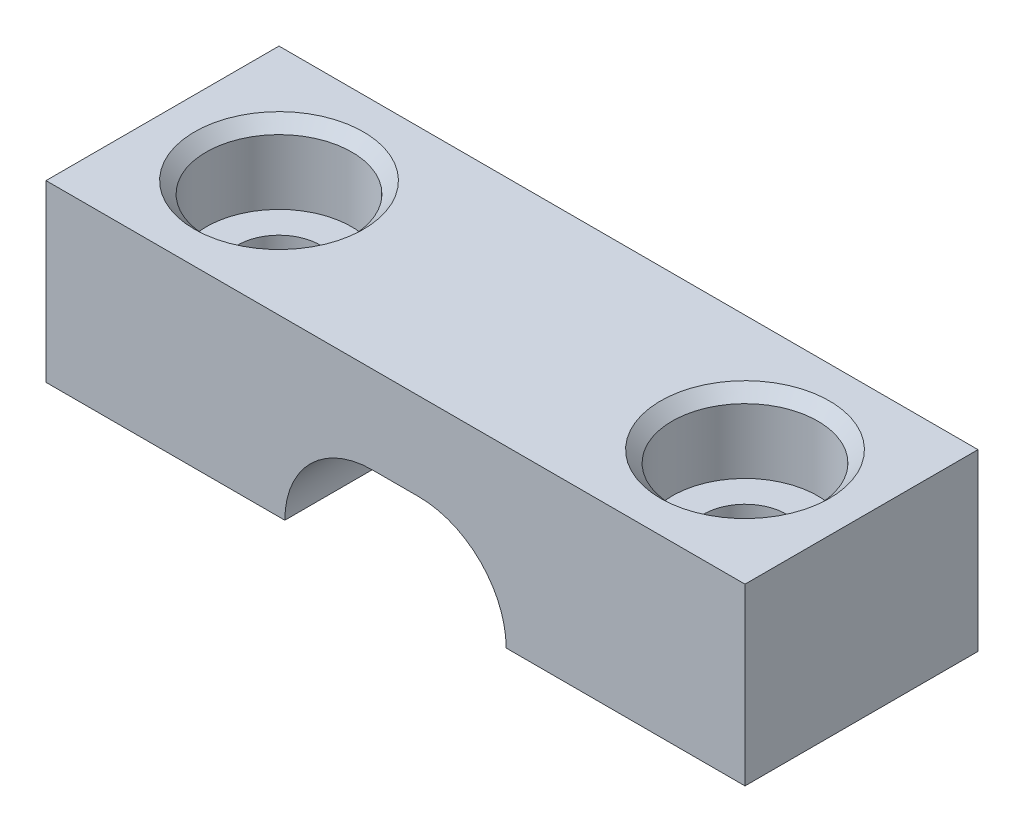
ISO-10303-21;
HEADER;
FILE_DESCRIPTION(('STEP AP214'),'2;1');
FILE_NAME('part.step','',(''),(''),'','','');
FILE_SCHEMA(('AUTOMOTIVE_DESIGN { 1 0 10303 214 1 1 1 1 }'));
ENDSEC;
DATA;
#1=APPLICATION_CONTEXT('core data for automotive mechanical design processes');
#2=APPLICATION_PROTOCOL_DEFINITION('international standard','automotive_design',2000,#1);
#3=PRODUCT_CONTEXT('',#1,'mechanical');
#4=PRODUCT('Part','Part','',(#3));
#5=PRODUCT_RELATED_PRODUCT_CATEGORY('part','',(#4));
#6=PRODUCT_DEFINITION_FORMATION('','',#4);
#7=PRODUCT_DEFINITION_CONTEXT('part definition',#1,'design');
#8=PRODUCT_DEFINITION('design','',#6,#7);
#9=PRODUCT_DEFINITION_SHAPE('','',#8);
#10=(LENGTH_UNIT() NAMED_UNIT(*) SI_UNIT(.MILLI.,.METRE.));
#11=(NAMED_UNIT(*) PLANE_ANGLE_UNIT() SI_UNIT($,.RADIAN.));
#12=(NAMED_UNIT(*) SI_UNIT($,.STERADIAN.) SOLID_ANGLE_UNIT());
#13=UNCERTAINTY_MEASURE_WITH_UNIT(LENGTH_MEASURE(1.E-05),#10,'distance_accuracy_value','');
#14=(GEOMETRIC_REPRESENTATION_CONTEXT(3) GLOBAL_UNCERTAINTY_ASSIGNED_CONTEXT((#13)) GLOBAL_UNIT_ASSIGNED_CONTEXT((#10,
#11,#12)) REPRESENTATION_CONTEXT('',''));
#15=CARTESIAN_POINT('',(0.,0.,0.));
#16=DIRECTION('',(0.,0.,1.));
#17=DIRECTION('',(1.,0.,0.));
#18=AXIS2_PLACEMENT_3D('',#15,#16,#17);
#19=CARTESIAN_POINT('',(0.,0.,12.7));
#20=DIRECTION('',(1.,0.,0.));
#21=DIRECTION('',(0.,0.,-1.));
#22=AXIS2_PLACEMENT_3D('',#19,#20,#21);
#23=PLANE('',#22);
#24=DIRECTION('',(0.,-1.,0.));
#25=VECTOR('',#24,1.);
#26=CARTESIAN_POINT('',(0.,0.,0.));
#27=LINE('',#26,#25);
#28=CARTESIAN_POINT('',(0.,9.525,0.));
#29=VERTEX_POINT('',#28);
#30=CARTESIAN_POINT('',(0.,0.,0.));
#31=VERTEX_POINT('',#30);
#32=EDGE_CURVE('E127',#29,#31,#27,.T.);
#33=ORIENTED_EDGE('',*,*,#32,.T.);
#34=DIRECTION('',(0.,0.,-1.));
#35=VECTOR('',#34,1.);
#36=CARTESIAN_POINT('',(0.,0.,12.7));
#37=LINE('',#36,#35);
#38=CARTESIAN_POINT('',(0.,0.,12.7));
#39=VERTEX_POINT('',#38);
#40=EDGE_CURVE('E11',#39,#31,#37,.T.);
#41=ORIENTED_EDGE('',*,*,#40,.F.);
#42=DIRECTION('',(0.,-1.,0.));
#43=VECTOR('',#42,1.);
#44=CARTESIAN_POINT('',(0.,0.,12.7));
#45=LINE('',#44,#43);
#46=CARTESIAN_POINT('',(0.,9.525,12.7));
#47=VERTEX_POINT('',#46);
#48=EDGE_CURVE('E142',#47,#39,#45,.T.);
#49=ORIENTED_EDGE('',*,*,#48,.F.);
#50=DIRECTION('',(0.,0.,-1.));
#51=VECTOR('',#50,1.);
#52=CARTESIAN_POINT('',(0.,9.525,12.7));
#53=LINE('',#52,#51);
#54=EDGE_CURVE('E123',#47,#29,#53,.T.);
#55=ORIENTED_EDGE('',*,*,#54,.T.);
#56=EDGE_LOOP('',(#33,#41,#49,#55));
#57=FACE_BOUND('',#56,.T.);
#58=ADVANCED_FACE('F31',(#57),#23,.F.);
#59=CARTESIAN_POINT('',(0.,0.,12.7));
#60=DIRECTION('',(0.,1.,0.));
#61=DIRECTION('',(0.,0.,1.));
#62=AXIS2_PLACEMENT_3D('',#59,#60,#61);
#63=PLANE('',#62);
#64=CARTESIAN_POINT('',(6.35,0.,6.35));
#65=DIRECTION('',(0.,1.,0.));
#66=DIRECTION('',(0.,0.,1.));
#67=AXIS2_PLACEMENT_3D('',#64,#65,#66);
#68=CIRCLE('',#67,2.2479);
#69=CARTESIAN_POINT('',(6.35,0.,8.5979));
#70=VERTEX_POINT('',#69);
#71=EDGE_CURVE('E189',#70,#70,#68,.T.);
#72=ORIENTED_EDGE('',*,*,#71,.T.);
#73=EDGE_LOOP('',(#72));
#74=FACE_BOUND('',#73,.T.);
#75=DIRECTION('',(1.,0.,0.));
#76=VECTOR('',#75,1.);
#77=CARTESIAN_POINT('',(0.,0.,0.));
#78=LINE('',#77,#76);
#79=CARTESIAN_POINT('',(13.0175,0.,0.));
#80=VERTEX_POINT('',#79);
#81=EDGE_CURVE('E130',#31,#80,#78,.T.);
#82=ORIENTED_EDGE('',*,*,#81,.T.);
#83=DIRECTION('',(0.,0.,-1.));
#84=VECTOR('',#83,1.);
#85=CARTESIAN_POINT('',(13.0175,0.,12.7));
#86=LINE('',#85,#84);
#87=CARTESIAN_POINT('',(13.0175,0.,12.7));
#88=VERTEX_POINT('',#87);
#89=EDGE_CURVE('E39',#88,#80,#86,.T.);
#90=ORIENTED_EDGE('',*,*,#89,.F.);
#91=DIRECTION('',(1.,0.,0.));
#92=VECTOR('',#91,1.);
#93=CARTESIAN_POINT('',(0.,0.,12.7));
#94=LINE('',#93,#92);
#95=EDGE_CURVE('E90',#39,#88,#94,.T.);
#96=ORIENTED_EDGE('',*,*,#95,.F.);
#97=ORIENTED_EDGE('',*,*,#40,.T.);
#98=EDGE_LOOP('',(#82,#90,#96,#97));
#99=FACE_BOUND('',#98,.T.);
#100=ADVANCED_FACE('F231',(#74,#99),#63,.F.);
#101=CARTESIAN_POINT('',(17.78,0.,12.7));
#102=DIRECTION('',(0.,0.,-1.));
#103=DIRECTION('',(-1.,0.,0.));
#104=AXIS2_PLACEMENT_3D('',#101,#102,#103);
#105=CYLINDRICAL_SURFACE('',#104,4.7625);
#106=CARTESIAN_POINT('',(17.78,0.,0.));
#107=DIRECTION('',(0.,0.,-1.));
#108=DIRECTION('',(-1.,0.,0.));
#109=AXIS2_PLACEMENT_3D('',#106,#107,#108);
#110=CIRCLE('',#109,4.7625);
#111=CARTESIAN_POINT('',(17.78,4.7625,0.));
#112=VERTEX_POINT('',#111);
#113=EDGE_CURVE('E133',#80,#112,#110,.T.);
#114=ORIENTED_EDGE('',*,*,#113,.T.);
#115=DIRECTION('',(0.,0.,-1.));
#116=VECTOR('',#115,1.);
#117=CARTESIAN_POINT('',(17.78,4.7625,12.7));
#118=LINE('',#117,#116);
#119=CARTESIAN_POINT('',(17.78,4.7625,12.7));
#120=VERTEX_POINT('',#119);
#121=EDGE_CURVE('E149',#120,#112,#118,.T.);
#122=ORIENTED_EDGE('',*,*,#121,.F.);
#123=CARTESIAN_POINT('',(17.78,0.,12.7));
#124=DIRECTION('',(0.,0.,-1.));
#125=DIRECTION('',(-1.,0.,0.));
#126=AXIS2_PLACEMENT_3D('',#123,#124,#125);
#127=CIRCLE('',#126,4.7625);
#128=EDGE_CURVE('E157',#88,#120,#127,.T.);
#129=ORIENTED_EDGE('',*,*,#128,.F.);
#130=ORIENTED_EDGE('',*,*,#89,.T.);
#131=EDGE_LOOP('',(#114,#122,#129,#130));
#132=FACE_BOUND('',#131,.T.);
#133=ADVANCED_FACE('F155',(#132),#105,.F.);
#134=CARTESIAN_POINT('',(17.78,4.7625,12.7));
#135=DIRECTION('',(0.,1.,0.));
#136=DIRECTION('',(-1.,0.,0.));
#137=AXIS2_PLACEMENT_3D('',#134,#135,#136);
#138=PLANE('',#137);
#139=DIRECTION('',(1.,0.,0.));
#140=VECTOR('',#139,1.);
#141=CARTESIAN_POINT('',(17.78,4.7625,0.));
#142=LINE('',#141,#140);
#143=CARTESIAN_POINT('',(20.32,4.7625,0.));
#144=VERTEX_POINT('',#143);
#145=EDGE_CURVE('E135',#112,#144,#142,.T.);
#146=ORIENTED_EDGE('',*,*,#145,.T.);
#147=DIRECTION('',(0.,0.,-1.));
#148=VECTOR('',#147,1.);
#149=CARTESIAN_POINT('',(20.32,4.7625,12.7));
#150=LINE('',#149,#148);
#151=CARTESIAN_POINT('',(20.32,4.7625,12.7));
#152=VERTEX_POINT('',#151);
#153=EDGE_CURVE('E146',#152,#144,#150,.T.);
#154=ORIENTED_EDGE('',*,*,#153,.F.);
#155=DIRECTION('',(1.,0.,0.));
#156=VECTOR('',#155,1.);
#157=CARTESIAN_POINT('',(17.78,4.7625,12.7));
#158=LINE('',#157,#156);
#159=EDGE_CURVE('E169',#120,#152,#158,.T.);
#160=ORIENTED_EDGE('',*,*,#159,.F.);
#161=ORIENTED_EDGE('',*,*,#121,.T.);
#162=EDGE_LOOP('',(#146,#154,#160,#161));
#163=FACE_BOUND('',#162,.T.);
#164=ADVANCED_FACE('F165',(#163),#138,.F.);
#165=CARTESIAN_POINT('',(20.32,0.,12.7));
#166=DIRECTION('',(0.,0.,-1.));
#167=DIRECTION('',(-1.,0.,0.));
#168=AXIS2_PLACEMENT_3D('',#165,#166,#167);
#169=CYLINDRICAL_SURFACE('',#168,4.7625);
#170=CARTESIAN_POINT('',(20.32,0.,0.));
#171=DIRECTION('',(0.,0.,-1.));
#172=DIRECTION('',(1.,0.,0.));
#173=AXIS2_PLACEMENT_3D('',#170,#171,#172);
#174=CIRCLE('',#173,4.7625);
#175=CARTESIAN_POINT('',(25.0825,0.,0.));
#176=VERTEX_POINT('',#175);
#177=EDGE_CURVE('E137',#144,#176,#174,.T.);
#178=ORIENTED_EDGE('',*,*,#177,.T.);
#179=DIRECTION('',(0.,0.,-1.));
#180=VECTOR('',#179,1.);
#181=CARTESIAN_POINT('',(25.0825,0.,12.7));
#182=LINE('',#181,#180);
#183=CARTESIAN_POINT('',(25.0825,0.,12.7));
#184=VERTEX_POINT('',#183);
#185=EDGE_CURVE('E118',#184,#176,#182,.T.);
#186=ORIENTED_EDGE('',*,*,#185,.F.);
#187=CARTESIAN_POINT('',(20.32,0.,12.7));
#188=DIRECTION('',(0.,0.,-1.));
#189=DIRECTION('',(1.,0.,0.));
#190=AXIS2_PLACEMENT_3D('',#187,#188,#189);
#191=CIRCLE('',#190,4.7625);
#192=EDGE_CURVE('E109',#152,#184,#191,.T.);
#193=ORIENTED_EDGE('',*,*,#192,.F.);
#194=ORIENTED_EDGE('',*,*,#153,.T.);
#195=EDGE_LOOP('',(#178,#186,#193,#194));
#196=FACE_BOUND('',#195,.T.);
#197=ADVANCED_FACE('F168',(#196),#169,.F.);
#198=CARTESIAN_POINT('',(25.0825,0.,12.7));
#199=DIRECTION('',(0.,1.,0.));
#200=DIRECTION('',(0.,0.,1.));
#201=AXIS2_PLACEMENT_3D('',#198,#199,#200);
#202=PLANE('',#201);
#203=CARTESIAN_POINT('',(31.75,0.,6.35));
#204=DIRECTION('',(0.,1.,0.));
#205=DIRECTION('',(0.,0.,1.));
#206=AXIS2_PLACEMENT_3D('',#203,#204,#205);
#207=CIRCLE('',#206,2.2479);
#208=CARTESIAN_POINT('',(31.75,0.,8.5979));
#209=VERTEX_POINT('',#208);
#210=EDGE_CURVE('E131',#209,#209,#207,.T.);
#211=ORIENTED_EDGE('',*,*,#210,.T.);
#212=EDGE_LOOP('',(#211));
#213=FACE_BOUND('',#212,.T.);
#214=DIRECTION('',(1.,0.,0.));
#215=VECTOR('',#214,1.);
#216=CARTESIAN_POINT('',(25.0825,0.,0.));
#217=LINE('',#216,#215);
#218=CARTESIAN_POINT('',(38.1,0.,0.));
#219=VERTEX_POINT('',#218);
#220=EDGE_CURVE('E117',#176,#219,#217,.T.);
#221=ORIENTED_EDGE('',*,*,#220,.T.);
#222=DIRECTION('',(0.,0.,-1.));
#223=VECTOR('',#222,1.);
#224=CARTESIAN_POINT('',(38.1,0.,12.7));
#225=LINE('',#224,#223);
#226=CARTESIAN_POINT('',(38.1,0.,12.7));
#227=VERTEX_POINT('',#226);
#228=EDGE_CURVE('E114',#227,#219,#225,.T.);
#229=ORIENTED_EDGE('',*,*,#228,.F.);
#230=DIRECTION('',(1.,0.,0.));
#231=VECTOR('',#230,1.);
#232=CARTESIAN_POINT('',(25.0825,0.,12.7));
#233=LINE('',#232,#231);
#234=EDGE_CURVE('E103',#184,#227,#233,.T.);
#235=ORIENTED_EDGE('',*,*,#234,.F.);
#236=ORIENTED_EDGE('',*,*,#185,.T.);
#237=EDGE_LOOP('',(#221,#229,#235,#236));
#238=FACE_BOUND('',#237,.T.);
#239=ADVANCED_FACE('F115',(#213,#238),#202,.F.);
#240=CARTESIAN_POINT('',(38.1,0.,12.7));
#241=DIRECTION('',(-1.,0.,0.));
#242=DIRECTION('',(0.,0.,1.));
#243=AXIS2_PLACEMENT_3D('',#240,#241,#242);
#244=PLANE('',#243);
#245=DIRECTION('',(0.,1.,0.));
#246=VECTOR('',#245,1.);
#247=CARTESIAN_POINT('',(38.1,0.,0.));
#248=LINE('',#247,#246);
#249=CARTESIAN_POINT('',(38.1,9.525,0.));
#250=VERTEX_POINT('',#249);
#251=EDGE_CURVE('E76',#219,#250,#248,.T.);
#252=ORIENTED_EDGE('',*,*,#251,.T.);
#253=DIRECTION('',(0.,0.,-1.));
#254=VECTOR('',#253,1.);
#255=CARTESIAN_POINT('',(38.1,9.525,12.7));
#256=LINE('',#255,#254);
#257=CARTESIAN_POINT('',(38.1,9.525,12.7));
#258=VERTEX_POINT('',#257);
#259=EDGE_CURVE('E119',#258,#250,#256,.T.);
#260=ORIENTED_EDGE('',*,*,#259,.F.);
#261=DIRECTION('',(0.,1.,0.));
#262=VECTOR('',#261,1.);
#263=CARTESIAN_POINT('',(38.1,0.,12.7));
#264=LINE('',#263,#262);
#265=EDGE_CURVE('E107',#227,#258,#264,.T.);
#266=ORIENTED_EDGE('',*,*,#265,.F.);
#267=ORIENTED_EDGE('',*,*,#228,.T.);
#268=EDGE_LOOP('',(#252,#260,#266,#267));
#269=FACE_BOUND('',#268,.T.);
#270=ADVANCED_FACE('F121',(#269),#244,.F.);
#271=CARTESIAN_POINT('',(0.,9.525,12.7));
#272=DIRECTION('',(0.,-1.,0.));
#273=DIRECTION('',(0.,0.,-1.));
#274=AXIS2_PLACEMENT_3D('',#271,#272,#273);
#275=PLANE('',#274);
#276=CARTESIAN_POINT('',(6.35,9.525,6.35));
#277=DIRECTION('',(0.,1.,0.));
#278=DIRECTION('',(0.,0.,1.));
#279=AXIS2_PLACEMENT_3D('',#276,#277,#278);
#280=CIRCLE('',#279,4.60375);
#281=CARTESIAN_POINT('',(6.35,9.525,10.95375));
#282=VERTEX_POINT('',#281);
#283=EDGE_CURVE('E201',#282,#282,#280,.T.);
#284=ORIENTED_EDGE('',*,*,#283,.F.);
#285=EDGE_LOOP('',(#284));
#286=FACE_BOUND('',#285,.T.);
#287=CARTESIAN_POINT('',(31.75,9.525,6.35));
#288=DIRECTION('',(0.,1.,0.));
#289=DIRECTION('',(0.,0.,1.));
#290=AXIS2_PLACEMENT_3D('',#287,#288,#289);
#291=CIRCLE('',#290,4.60375);
#292=CARTESIAN_POINT('',(31.75,9.525,10.95375));
#293=VERTEX_POINT('',#292);
#294=EDGE_CURVE('E186',#293,#293,#291,.T.);
#295=ORIENTED_EDGE('',*,*,#294,.F.);
#296=EDGE_LOOP('',(#295));
#297=FACE_BOUND('',#296,.T.);
#298=DIRECTION('',(-1.,0.,0.));
#299=VECTOR('',#298,1.);
#300=CARTESIAN_POINT('',(0.,9.525,0.));
#301=LINE('',#300,#299);
#302=EDGE_CURVE('E82',#250,#29,#301,.T.);
#303=ORIENTED_EDGE('',*,*,#302,.T.);
#304=ORIENTED_EDGE('',*,*,#54,.F.);
#305=DIRECTION('',(-1.,0.,0.));
#306=VECTOR('',#305,1.);
#307=CARTESIAN_POINT('',(0.,9.525,12.7));
#308=LINE('',#307,#306);
#309=EDGE_CURVE('E47',#258,#47,#308,.T.);
#310=ORIENTED_EDGE('',*,*,#309,.F.);
#311=ORIENTED_EDGE('',*,*,#259,.T.);
#312=EDGE_LOOP('',(#303,#304,#310,#311));
#313=FACE_BOUND('',#312,.T.);
#314=ADVANCED_FACE('F207',(#286,#297,#313),#275,.F.);
#315=CARTESIAN_POINT('',(20.32,0.,12.7));
#316=DIRECTION('',(0.,0.,1.));
#317=DIRECTION('',(1.,0.,0.));
#318=AXIS2_PLACEMENT_3D('',#315,#316,#317);
#319=PLANE('',#318);
#320=ORIENTED_EDGE('',*,*,#48,.T.);
#321=ORIENTED_EDGE('',*,*,#95,.T.);
#322=ORIENTED_EDGE('',*,*,#128,.T.);
#323=ORIENTED_EDGE('',*,*,#159,.T.);
#324=ORIENTED_EDGE('',*,*,#192,.T.);
#325=ORIENTED_EDGE('',*,*,#234,.T.);
#326=ORIENTED_EDGE('',*,*,#265,.T.);
#327=ORIENTED_EDGE('',*,*,#309,.T.);
#328=EDGE_LOOP('',(#320,#321,#322,#323,#324,#325,#326,#327));
#329=FACE_BOUND('',#328,.T.);
#330=ADVANCED_FACE('F105',(#329),#319,.T.);
#331=CARTESIAN_POINT('',(20.32,0.,0.));
#332=DIRECTION('',(0.,0.,1.));
#333=DIRECTION('',(1.,0.,0.));
#334=AXIS2_PLACEMENT_3D('',#331,#332,#333);
#335=PLANE('',#334);
#336=ORIENTED_EDGE('',*,*,#32,.F.);
#337=ORIENTED_EDGE('',*,*,#302,.F.);
#338=ORIENTED_EDGE('',*,*,#251,.F.);
#339=ORIENTED_EDGE('',*,*,#220,.F.);
#340=ORIENTED_EDGE('',*,*,#177,.F.);
#341=ORIENTED_EDGE('',*,*,#145,.F.);
#342=ORIENTED_EDGE('',*,*,#113,.F.);
#343=ORIENTED_EDGE('',*,*,#81,.F.);
#344=EDGE_LOOP('',(#336,#337,#338,#339,#340,#341,#342,#343));
#345=FACE_BOUND('',#344,.T.);
#346=ADVANCED_FACE('F161',(#345),#335,.F.);
#347=CARTESIAN_POINT('',(31.75,9.525,6.35));
#348=DIRECTION('',(0.,1.,0.));
#349=DIRECTION('',(0.,0.,1.));
#350=AXIS2_PLACEMENT_3D('',#347,#348,#349);
#351=CYLINDRICAL_SURFACE('',#350,2.2479);
#352=ORIENTED_EDGE('',*,*,#210,.F.);
#353=EDGE_LOOP('',(#352));
#354=FACE_BOUND('',#353,.T.);
#355=CARTESIAN_POINT('',(31.75,5.3594,6.35));
#356=DIRECTION('',(0.,1.,0.));
#357=DIRECTION('',(0.,0.,1.));
#358=AXIS2_PLACEMENT_3D('',#355,#356,#357);
#359=CIRCLE('',#358,2.2479);
#360=CARTESIAN_POINT('',(31.75,5.3594,8.5979));
#361=VERTEX_POINT('',#360);
#362=EDGE_CURVE('E177',#361,#361,#359,.T.);
#363=ORIENTED_EDGE('',*,*,#362,.T.);
#364=EDGE_LOOP('',(#363));
#365=FACE_BOUND('',#364,.T.);
#366=ADVANCED_FACE('F255',(#354,#365),#351,.F.);
#367=CARTESIAN_POINT('',(35.71875,5.3594,6.35));
#368=DIRECTION('',(0.,-1.,0.));
#369=DIRECTION('',(0.,0.,-1.));
#370=AXIS2_PLACEMENT_3D('',#367,#368,#369);
#371=PLANE('',#370);
#372=ORIENTED_EDGE('',*,*,#362,.F.);
#373=EDGE_LOOP('',(#372));
#374=FACE_BOUND('',#373,.T.);
#375=CARTESIAN_POINT('',(31.75,5.3594,6.35));
#376=DIRECTION('',(0.,1.,0.));
#377=DIRECTION('',(0.,0.,1.));
#378=AXIS2_PLACEMENT_3D('',#375,#376,#377);
#379=CIRCLE('',#378,3.96875);
#380=CARTESIAN_POINT('',(31.75,5.3594,10.31875));
#381=VERTEX_POINT('',#380);
#382=EDGE_CURVE('E180',#381,#381,#379,.T.);
#383=ORIENTED_EDGE('',*,*,#382,.T.);
#384=EDGE_LOOP('',(#383));
#385=FACE_BOUND('',#384,.T.);
#386=ADVANCED_FACE('F226',(#374,#385),#371,.F.);
#387=CARTESIAN_POINT('',(31.75,9.525,6.35));
#388=DIRECTION('',(0.,1.,0.));
#389=DIRECTION('',(0.,0.,1.));
#390=AXIS2_PLACEMENT_3D('',#387,#388,#389);
#391=CYLINDRICAL_SURFACE('',#390,3.96875);
#392=ORIENTED_EDGE('',*,*,#382,.F.);
#393=EDGE_LOOP('',(#392));
#394=FACE_BOUND('',#393,.T.);
#395=CARTESIAN_POINT('',(31.75,8.89,6.35));
#396=DIRECTION('',(0.,1.,0.));
#397=DIRECTION('',(0.,0.,1.));
#398=AXIS2_PLACEMENT_3D('',#395,#396,#397);
#399=CIRCLE('',#398,3.96875);
#400=CARTESIAN_POINT('',(31.75,8.89,10.31875));
#401=VERTEX_POINT('',#400);
#402=EDGE_CURVE('E183',#401,#401,#399,.T.);
#403=ORIENTED_EDGE('',*,*,#402,.T.);
#404=EDGE_LOOP('',(#403));
#405=FACE_BOUND('',#404,.T.);
#406=ADVANCED_FACE('F216',(#394,#405),#391,.F.);
#407=CARTESIAN_POINT('',(31.75,9.525,6.35));
#408=DIRECTION('',(0.,1.,0.));
#409=DIRECTION('',(0.,0.,1.));
#410=AXIS2_PLACEMENT_3D('',#407,#408,#409);
#411=CONICAL_SURFACE('',#410,4.60375,0.785398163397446);
#412=ORIENTED_EDGE('',*,*,#402,.F.);
#413=EDGE_LOOP('',(#412));
#414=FACE_BOUND('',#413,.T.);
#415=ORIENTED_EDGE('',*,*,#294,.T.);
#416=EDGE_LOOP('',(#415));
#417=FACE_BOUND('',#416,.T.);
#418=ADVANCED_FACE('F213',(#414,#417),#411,.F.);
#419=CARTESIAN_POINT('',(6.35,9.525,6.35));
#420=DIRECTION('',(0.,1.,0.));
#421=DIRECTION('',(0.,0.,1.));
#422=AXIS2_PLACEMENT_3D('',#419,#420,#421);
#423=CYLINDRICAL_SURFACE('',#422,2.2479);
#424=ORIENTED_EDGE('',*,*,#71,.F.);
#425=EDGE_LOOP('',(#424));
#426=FACE_BOUND('',#425,.T.);
#427=CARTESIAN_POINT('',(6.35,5.3594,6.35));
#428=DIRECTION('',(0.,1.,0.));
#429=DIRECTION('',(0.,0.,1.));
#430=AXIS2_PLACEMENT_3D('',#427,#428,#429);
#431=CIRCLE('',#430,2.2479);
#432=CARTESIAN_POINT('',(6.35,5.3594,8.5979));
#433=VERTEX_POINT('',#432);
#434=EDGE_CURVE('E192',#433,#433,#431,.T.);
#435=ORIENTED_EDGE('',*,*,#434,.T.);
#436=EDGE_LOOP('',(#435));
#437=FACE_BOUND('',#436,.T.);
#438=ADVANCED_FACE('F215',(#426,#437),#423,.F.);
#439=CARTESIAN_POINT('',(10.31875,5.3594,6.35));
#440=DIRECTION('',(0.,-1.,0.));
#441=DIRECTION('',(0.,0.,-1.));
#442=AXIS2_PLACEMENT_3D('',#439,#440,#441);
#443=PLANE('',#442);
#444=ORIENTED_EDGE('',*,*,#434,.F.);
#445=EDGE_LOOP('',(#444));
#446=FACE_BOUND('',#445,.T.);
#447=CARTESIAN_POINT('',(6.35,5.3594,6.35));
#448=DIRECTION('',(0.,1.,0.));
#449=DIRECTION('',(0.,0.,1.));
#450=AXIS2_PLACEMENT_3D('',#447,#448,#449);
#451=CIRCLE('',#450,3.96875);
#452=CARTESIAN_POINT('',(6.35,5.3594,10.31875));
#453=VERTEX_POINT('',#452);
#454=EDGE_CURVE('E195',#453,#453,#451,.T.);
#455=ORIENTED_EDGE('',*,*,#454,.T.);
#456=EDGE_LOOP('',(#455));
#457=FACE_BOUND('',#456,.T.);
#458=ADVANCED_FACE('F223',(#446,#457),#443,.F.);
#459=CARTESIAN_POINT('',(6.35,9.525,6.35));
#460=DIRECTION('',(0.,1.,0.));
#461=DIRECTION('',(0.,0.,1.));
#462=AXIS2_PLACEMENT_3D('',#459,#460,#461);
#463=CYLINDRICAL_SURFACE('',#462,3.96875);
#464=ORIENTED_EDGE('',*,*,#454,.F.);
#465=EDGE_LOOP('',(#464));
#466=FACE_BOUND('',#465,.T.);
#467=CARTESIAN_POINT('',(6.35,8.89,6.35));
#468=DIRECTION('',(0.,1.,0.));
#469=DIRECTION('',(0.,0.,1.));
#470=AXIS2_PLACEMENT_3D('',#467,#468,#469);
#471=CIRCLE('',#470,3.96875);
#472=CARTESIAN_POINT('',(6.35,8.89,10.31875));
#473=VERTEX_POINT('',#472);
#474=EDGE_CURVE('E198',#473,#473,#471,.T.);
#475=ORIENTED_EDGE('',*,*,#474,.T.);
#476=EDGE_LOOP('',(#475));
#477=FACE_BOUND('',#476,.T.);
#478=ADVANCED_FACE('F295',(#466,#477),#463,.F.);
#479=CARTESIAN_POINT('',(6.35,9.525,6.35));
#480=DIRECTION('',(0.,1.,0.));
#481=DIRECTION('',(0.,0.,1.));
#482=AXIS2_PLACEMENT_3D('',#479,#480,#481);
#483=CONICAL_SURFACE('',#482,4.60375,0.785398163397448);
#484=ORIENTED_EDGE('',*,*,#474,.F.);
#485=EDGE_LOOP('',(#484));
#486=FACE_BOUND('',#485,.T.);
#487=ORIENTED_EDGE('',*,*,#283,.T.);
#488=EDGE_LOOP('',(#487));
#489=FACE_BOUND('',#488,.T.);
#490=ADVANCED_FACE('F205',(#486,#489),#483,.F.);
#491=CLOSED_SHELL('',(#58,#100,#133,#164,#197,#239,#270,#314,#330,#346,#366,#386,#406,#418,#438,
#458,#478,#490));
#492=MANIFOLD_SOLID_BREP('B2',#491);
#493=ADVANCED_BREP_SHAPE_REPRESENTATION('',(#18,#492),#14);
#494=SHAPE_DEFINITION_REPRESENTATION(#9,#493);
ENDSEC;
END-ISO-10303-21;
